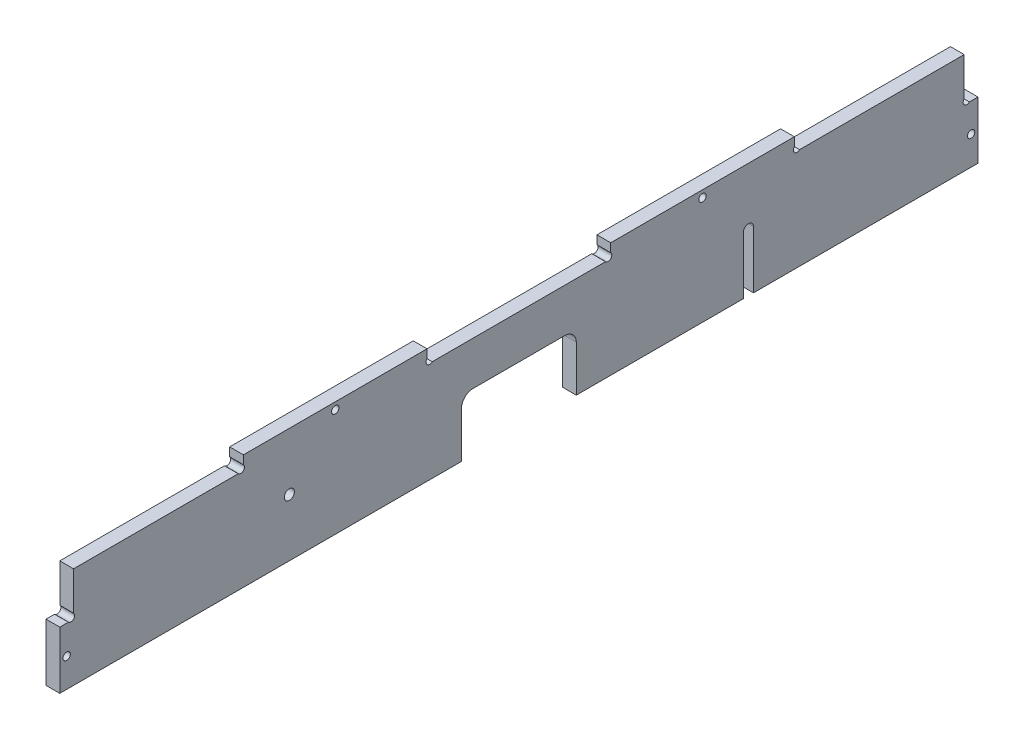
ISO-10303-21;
HEADER;
FILE_DESCRIPTION(('STEP AP214'),'2;1');
FILE_NAME('part.step','',(''),(''),'','','');
FILE_SCHEMA(('AUTOMOTIVE_DESIGN { 1 0 10303 214 1 1 1 1 }'));
ENDSEC;
DATA;
#1=APPLICATION_CONTEXT('core data for automotive mechanical design processes');
#2=APPLICATION_PROTOCOL_DEFINITION('international standard','automotive_design',2000,#1);
#3=PRODUCT_CONTEXT('',#1,'mechanical');
#4=PRODUCT('Part','Part','',(#3));
#5=PRODUCT_RELATED_PRODUCT_CATEGORY('part','',(#4));
#6=PRODUCT_DEFINITION_FORMATION('','',#4);
#7=PRODUCT_DEFINITION_CONTEXT('part definition',#1,'design');
#8=PRODUCT_DEFINITION('design','',#6,#7);
#9=PRODUCT_DEFINITION_SHAPE('','',#8);
#10=(LENGTH_UNIT() NAMED_UNIT(*) SI_UNIT(.MILLI.,.METRE.));
#11=(NAMED_UNIT(*) PLANE_ANGLE_UNIT() SI_UNIT($,.RADIAN.));
#12=(NAMED_UNIT(*) SI_UNIT($,.STERADIAN.) SOLID_ANGLE_UNIT());
#13=UNCERTAINTY_MEASURE_WITH_UNIT(LENGTH_MEASURE(1.E-05),#10,'distance_accuracy_value','');
#14=(GEOMETRIC_REPRESENTATION_CONTEXT(3) GLOBAL_UNCERTAINTY_ASSIGNED_CONTEXT((#13)) GLOBAL_UNIT_ASSIGNED_CONTEXT((#10,
#11,#12)) REPRESENTATION_CONTEXT('',''));
#15=CARTESIAN_POINT('',(0.,0.,0.));
#16=DIRECTION('',(0.,0.,1.));
#17=DIRECTION('',(1.,0.,0.));
#18=AXIS2_PLACEMENT_3D('',#15,#16,#17);
#19=CARTESIAN_POINT('',(6.,45.1313708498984,-38.8686291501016));
#20=DIRECTION('',(1.,0.,0.));
#21=DIRECTION('',(0.,0.,-1.));
#22=AXIS2_PLACEMENT_3D('',#19,#20,#21);
#23=PLANE('',#22);
#24=CARTESIAN_POINT('',(6.,12.5,197.));
#25=DIRECTION('',(1.,0.,0.));
#26=DIRECTION('',(0.,0.,1.));
#27=AXIS2_PLACEMENT_3D('',#24,#25,#26);
#28=CIRCLE('',#27,1.59999999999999);
#29=CARTESIAN_POINT('',(6.,12.5,198.6));
#30=VERTEX_POINT('',#29);
#31=EDGE_CURVE('E560',#30,#30,#28,.T.);
#32=ORIENTED_EDGE('',*,*,#31,.F.);
#33=EDGE_LOOP('',(#32));
#34=FACE_BOUND('',#33,.T.);
#35=CARTESIAN_POINT('',(6.,47.,80.));
#36=DIRECTION('',(1.,0.,0.));
#37=DIRECTION('',(0.,0.,1.));
#38=AXIS2_PLACEMENT_3D('',#35,#36,#37);
#39=CIRCLE('',#38,1.60000000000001);
#40=CARTESIAN_POINT('',(6.,47.,81.6));
#41=VERTEX_POINT('',#40);
#42=EDGE_CURVE('E572',#41,#41,#39,.T.);
#43=ORIENTED_EDGE('',*,*,#42,.F.);
#44=EDGE_LOOP('',(#43));
#45=FACE_BOUND('',#44,.T.);
#46=CARTESIAN_POINT('',(6.,45.1313708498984,-38.8686291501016));
#47=DIRECTION('',(-1.,0.,0.));
#48=DIRECTION('',(0.,0.,-1.));
#49=AXIS2_PLACEMENT_3D('',#46,#47,#48);
#50=CIRCLE('',#49,1.59999999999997);
#51=CARTESIAN_POINT('',(6.,46.2627416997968,-40.));
#52=VERTEX_POINT('',#51);
#53=CARTESIAN_POINT('',(6.,44.,-37.737258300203));
#54=VERTEX_POINT('',#53);
#55=EDGE_CURVE('E341',#52,#54,#50,.T.);
#56=ORIENTED_EDGE('',*,*,#55,.T.);
#57=DIRECTION('',(0.,0.,1.));
#58=VECTOR('',#57,1.);
#59=CARTESIAN_POINT('',(6.,44.,37.737258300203));
#60=LINE('',#59,#58);
#61=CARTESIAN_POINT('',(6.,44.,37.737258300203));
#62=VERTEX_POINT('',#61);
#63=EDGE_CURVE('E169',#54,#62,#60,.T.);
#64=ORIENTED_EDGE('',*,*,#63,.T.);
#65=CARTESIAN_POINT('',(6.,45.1313708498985,38.8686291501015));
#66=DIRECTION('',(-1.,0.,0.));
#67=DIRECTION('',(0.,0.,1.));
#68=AXIS2_PLACEMENT_3D('',#65,#66,#67);
#69=CIRCLE('',#68,1.60000000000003);
#70=CARTESIAN_POINT('',(6.,46.262741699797,40.));
#71=VERTEX_POINT('',#70);
#72=EDGE_CURVE('E428',#62,#71,#69,.T.);
#73=ORIENTED_EDGE('',*,*,#72,.T.);
#74=DIRECTION('',(0.,1.,0.));
#75=VECTOR('',#74,1.);
#76=CARTESIAN_POINT('',(6.,46.262741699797,40.));
#77=LINE('',#76,#75);
#78=CARTESIAN_POINT('',(6.,50.,40.));
#79=VERTEX_POINT('',#78);
#80=EDGE_CURVE('E447',#71,#79,#77,.T.);
#81=ORIENTED_EDGE('',*,*,#80,.T.);
#82=DIRECTION('',(0.,0.,1.));
#83=VECTOR('',#82,1.);
#84=CARTESIAN_POINT('',(6.,50.,40.));
#85=LINE('',#84,#83);
#86=CARTESIAN_POINT('',(6.,50.,120.));
#87=VERTEX_POINT('',#86);
#88=EDGE_CURVE('E444',#79,#87,#85,.T.);
#89=ORIENTED_EDGE('',*,*,#88,.T.);
#90=DIRECTION('',(0.,-1.,0.));
#91=VECTOR('',#90,1.);
#92=CARTESIAN_POINT('',(6.,50.,120.));
#93=LINE('',#92,#91);
#94=CARTESIAN_POINT('',(6.,46.262741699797,120.));
#95=VERTEX_POINT('',#94);
#96=EDGE_CURVE('E446',#87,#95,#93,.T.);
#97=ORIENTED_EDGE('',*,*,#96,.T.);
#98=CARTESIAN_POINT('',(6.,45.1313708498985,121.131370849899));
#99=DIRECTION('',(-1.,0.,0.));
#100=DIRECTION('',(0.,0.,-1.));
#101=AXIS2_PLACEMENT_3D('',#98,#99,#100);
#102=CIRCLE('',#101,1.60000000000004);
#103=CARTESIAN_POINT('',(6.,44.,122.262741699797));
#104=VERTEX_POINT('',#103);
#105=EDGE_CURVE('E449',#95,#104,#102,.T.);
#106=ORIENTED_EDGE('',*,*,#105,.T.);
#107=DIRECTION('',(0.,0.,1.));
#108=VECTOR('',#107,1.);
#109=CARTESIAN_POINT('',(6.,44.,122.262741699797));
#110=LINE('',#109,#108);
#111=CARTESIAN_POINT('',(6.,44.,194.));
#112=VERTEX_POINT('',#111);
#113=EDGE_CURVE('E455',#104,#112,#110,.T.);
#114=ORIENTED_EDGE('',*,*,#113,.T.);
#115=DIRECTION('',(0.,-1.,0.));
#116=VECTOR('',#115,1.);
#117=CARTESIAN_POINT('',(6.,44.,194.));
#118=LINE('',#117,#116);
#119=CARTESIAN_POINT('',(6.,27.2627416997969,194.));
#120=VERTEX_POINT('',#119);
#121=EDGE_CURVE('E457',#112,#120,#118,.T.);
#122=ORIENTED_EDGE('',*,*,#121,.T.);
#123=CARTESIAN_POINT('',(6.,26.1313708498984,195.131370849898));
#124=DIRECTION('',(-1.,0.,0.));
#125=DIRECTION('',(0.,0.,1.));
#126=AXIS2_PLACEMENT_3D('',#123,#124,#125);
#127=CIRCLE('',#126,1.59999999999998);
#128=CARTESIAN_POINT('',(6.,25.,196.262741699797));
#129=VERTEX_POINT('',#128);
#130=EDGE_CURVE('E459',#120,#129,#127,.T.);
#131=ORIENTED_EDGE('',*,*,#130,.T.);
#132=DIRECTION('',(0.,0.,1.));
#133=VECTOR('',#132,1.);
#134=CARTESIAN_POINT('',(6.,25.,196.262741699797));
#135=LINE('',#134,#133);
#136=CARTESIAN_POINT('',(6.,25.,200.));
#137=VERTEX_POINT('',#136);
#138=EDGE_CURVE('E461',#129,#137,#135,.T.);
#139=ORIENTED_EDGE('',*,*,#138,.T.);
#140=DIRECTION('',(0.,-1.,0.));
#141=VECTOR('',#140,1.);
#142=CARTESIAN_POINT('',(6.,25.,200.));
#143=LINE('',#142,#141);
#144=CARTESIAN_POINT('',(6.,0.,200.));
#145=VERTEX_POINT('',#144);
#146=EDGE_CURVE('E463',#137,#145,#143,.T.);
#147=ORIENTED_EDGE('',*,*,#146,.T.);
#148=DIRECTION('',(0.,0.,-1.));
#149=VECTOR('',#148,1.);
#150=CARTESIAN_POINT('',(6.,0.,200.));
#151=LINE('',#150,#149);
#152=CARTESIAN_POINT('',(6.,0.,25.));
#153=VERTEX_POINT('',#152);
#154=EDGE_CURVE('E465',#145,#153,#151,.T.);
#155=ORIENTED_EDGE('',*,*,#154,.T.);
#156=DIRECTION('',(0.,1.,0.));
#157=VECTOR('',#156,1.);
#158=CARTESIAN_POINT('',(6.,20.,25.));
#159=LINE('',#158,#157);
#160=CARTESIAN_POINT('',(6.,20.,25.));
#161=VERTEX_POINT('',#160);
#162=EDGE_CURVE('E467',#153,#161,#159,.T.);
#163=ORIENTED_EDGE('',*,*,#162,.T.);
#164=CARTESIAN_POINT('',(6.,20.,20.));
#165=DIRECTION('',(-1.,0.,0.));
#166=DIRECTION('',(0.,0.,1.));
#167=AXIS2_PLACEMENT_3D('',#164,#165,#166);
#168=CIRCLE('',#167,5.);
#169=CARTESIAN_POINT('',(6.,25.,20.));
#170=VERTEX_POINT('',#169);
#171=EDGE_CURVE('E469',#161,#170,#168,.T.);
#172=ORIENTED_EDGE('',*,*,#171,.T.);
#173=DIRECTION('',(0.,0.,-1.));
#174=VECTOR('',#173,1.);
#175=CARTESIAN_POINT('',(6.,25.,20.));
#176=LINE('',#175,#174);
#177=CARTESIAN_POINT('',(6.,25.,-20.));
#178=VERTEX_POINT('',#177);
#179=EDGE_CURVE('E471',#170,#178,#176,.T.);
#180=ORIENTED_EDGE('',*,*,#179,.T.);
#181=CARTESIAN_POINT('',(6.,20.,-20.));
#182=DIRECTION('',(-1.,0.,0.));
#183=DIRECTION('',(0.,0.,-1.));
#184=AXIS2_PLACEMENT_3D('',#181,#182,#183);
#185=CIRCLE('',#184,5.);
#186=CARTESIAN_POINT('',(6.,20.,-25.));
#187=VERTEX_POINT('',#186);
#188=EDGE_CURVE('E473',#178,#187,#185,.T.);
#189=ORIENTED_EDGE('',*,*,#188,.T.);
#190=DIRECTION('',(0.,-1.,0.));
#191=VECTOR('',#190,1.);
#192=CARTESIAN_POINT('',(6.,20.,-25.));
#193=LINE('',#192,#191);
#194=CARTESIAN_POINT('',(6.,0.,-25.));
#195=VERTEX_POINT('',#194);
#196=EDGE_CURVE('E475',#187,#195,#193,.T.);
#197=ORIENTED_EDGE('',*,*,#196,.T.);
#198=DIRECTION('',(0.,0.,-1.));
#199=VECTOR('',#198,1.);
#200=CARTESIAN_POINT('',(6.,0.,-25.));
#201=LINE('',#200,#199);
#202=CARTESIAN_POINT('',(6.,0.,-97.8));
#203=VERTEX_POINT('',#202);
#204=EDGE_CURVE('E477',#195,#203,#201,.T.);
#205=ORIENTED_EDGE('',*,*,#204,.T.);
#206=DIRECTION('',(0.,1.,0.));
#207=VECTOR('',#206,1.);
#208=CARTESIAN_POINT('',(6.,25.,-97.8));
#209=LINE('',#208,#207);
#210=CARTESIAN_POINT('',(6.,25.,-97.8));
#211=VERTEX_POINT('',#210);
#212=EDGE_CURVE('E479',#203,#211,#209,.T.);
#213=ORIENTED_EDGE('',*,*,#212,.T.);
#214=CARTESIAN_POINT('',(6.,25.,-100.));
#215=DIRECTION('',(-1.,0.,0.));
#216=DIRECTION('',(0.,0.,1.));
#217=AXIS2_PLACEMENT_3D('',#214,#215,#216);
#218=CIRCLE('',#217,2.19999999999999);
#219=CARTESIAN_POINT('',(6.,25.,-102.2));
#220=VERTEX_POINT('',#219);
#221=EDGE_CURVE('E481',#211,#220,#218,.T.);
#222=ORIENTED_EDGE('',*,*,#221,.T.);
#223=DIRECTION('',(0.,-1.,0.));
#224=VECTOR('',#223,1.);
#225=CARTESIAN_POINT('',(6.,25.,-102.2));
#226=LINE('',#225,#224);
#227=CARTESIAN_POINT('',(6.,0.,-102.2));
#228=VERTEX_POINT('',#227);
#229=EDGE_CURVE('E483',#220,#228,#226,.T.);
#230=ORIENTED_EDGE('',*,*,#229,.T.);
#231=DIRECTION('',(0.,0.,-1.));
#232=VECTOR('',#231,1.);
#233=CARTESIAN_POINT('',(6.,0.,-102.2));
#234=LINE('',#233,#232);
#235=CARTESIAN_POINT('',(6.,0.,-200.));
#236=VERTEX_POINT('',#235);
#237=EDGE_CURVE('E485',#228,#236,#234,.T.);
#238=ORIENTED_EDGE('',*,*,#237,.T.);
#239=DIRECTION('',(0.,1.,0.));
#240=VECTOR('',#239,1.);
#241=CARTESIAN_POINT('',(6.,25.,-200.));
#242=LINE('',#241,#240);
#243=CARTESIAN_POINT('',(6.,25.,-200.));
#244=VERTEX_POINT('',#243);
#245=EDGE_CURVE('E487',#236,#244,#242,.T.);
#246=ORIENTED_EDGE('',*,*,#245,.T.);
#247=DIRECTION('',(0.,0.,1.));
#248=VECTOR('',#247,1.);
#249=CARTESIAN_POINT('',(6.,25.,-196.262741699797));
#250=LINE('',#249,#248);
#251=CARTESIAN_POINT('',(6.,25.,-196.262741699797));
#252=VERTEX_POINT('',#251);
#253=EDGE_CURVE('E489',#244,#252,#250,.T.);
#254=ORIENTED_EDGE('',*,*,#253,.T.);
#255=CARTESIAN_POINT('',(6.,26.1313708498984,-195.131370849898));
#256=DIRECTION('',(-1.,0.,0.));
#257=DIRECTION('',(0.,0.,-1.));
#258=AXIS2_PLACEMENT_3D('',#255,#256,#257);
#259=CIRCLE('',#258,1.59999999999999);
#260=CARTESIAN_POINT('',(6.,27.2627416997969,-194.));
#261=VERTEX_POINT('',#260);
#262=EDGE_CURVE('E491',#252,#261,#259,.T.);
#263=ORIENTED_EDGE('',*,*,#262,.T.);
#264=DIRECTION('',(0.,1.,0.));
#265=VECTOR('',#264,1.);
#266=CARTESIAN_POINT('',(6.,44.,-194.));
#267=LINE('',#266,#265);
#268=CARTESIAN_POINT('',(6.,44.,-194.));
#269=VERTEX_POINT('',#268);
#270=EDGE_CURVE('E493',#261,#269,#267,.T.);
#271=ORIENTED_EDGE('',*,*,#270,.T.);
#272=DIRECTION('',(0.,0.,1.));
#273=VECTOR('',#272,1.);
#274=CARTESIAN_POINT('',(6.,44.,-122.262741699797));
#275=LINE('',#274,#273);
#276=CARTESIAN_POINT('',(6.,44.,-122.262741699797));
#277=VERTEX_POINT('',#276);
#278=EDGE_CURVE('E495',#269,#277,#275,.T.);
#279=ORIENTED_EDGE('',*,*,#278,.T.);
#280=CARTESIAN_POINT('',(6.,45.1313708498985,-121.131370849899));
#281=DIRECTION('',(-1.,0.,0.));
#282=DIRECTION('',(0.,0.,1.));
#283=AXIS2_PLACEMENT_3D('',#280,#281,#282);
#284=CIRCLE('',#283,1.60000000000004);
#285=CARTESIAN_POINT('',(6.,46.262741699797,-120.));
#286=VERTEX_POINT('',#285);
#287=EDGE_CURVE('E260',#277,#286,#284,.T.);
#288=ORIENTED_EDGE('',*,*,#287,.T.);
#289=DIRECTION('',(0.,1.,0.));
#290=VECTOR('',#289,1.);
#291=CARTESIAN_POINT('',(6.,50.,-120.));
#292=LINE('',#291,#290);
#293=CARTESIAN_POINT('',(6.,50.,-120.));
#294=VERTEX_POINT('',#293);
#295=EDGE_CURVE('E254',#286,#294,#292,.T.);
#296=ORIENTED_EDGE('',*,*,#295,.T.);
#297=DIRECTION('',(0.,0.,1.));
#298=VECTOR('',#297,1.);
#299=CARTESIAN_POINT('',(6.,50.,-40.));
#300=LINE('',#299,#298);
#301=CARTESIAN_POINT('',(6.,50.,-40.));
#302=VERTEX_POINT('',#301);
#303=EDGE_CURVE('E258',#294,#302,#300,.T.);
#304=ORIENTED_EDGE('',*,*,#303,.T.);
#305=DIRECTION('',(0.,-1.,0.));
#306=VECTOR('',#305,1.);
#307=CARTESIAN_POINT('',(6.,46.2627416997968,-40.));
#308=LINE('',#307,#306);
#309=EDGE_CURVE('E54',#302,#52,#308,.T.);
#310=ORIENTED_EDGE('',*,*,#309,.T.);
#311=EDGE_LOOP('',(#56,#64,#73,#81,#89,#97,#106,#114,#122,#131,#139,#147,#155,#163,#172,#180,
#189,#197,#205,#213,#222,#230,#238,#246,#254,#263,#271,#279,#288,#296,#304,#310));
#312=FACE_BOUND('',#311,.T.);
#313=CARTESIAN_POINT('',(6.,47.,-80.));
#314=DIRECTION('',(1.,0.,0.));
#315=DIRECTION('',(0.,0.,-1.));
#316=AXIS2_PLACEMENT_3D('',#313,#314,#315);
#317=CIRCLE('',#316,1.60000000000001);
#318=CARTESIAN_POINT('',(6.,47.,-81.6));
#319=VERTEX_POINT('',#318);
#320=EDGE_CURVE('E282',#319,#319,#317,.T.);
#321=ORIENTED_EDGE('',*,*,#320,.F.);
#322=EDGE_LOOP('',(#321));
#323=FACE_BOUND('',#322,.T.);
#324=CARTESIAN_POINT('',(6.,12.5,-197.));
#325=DIRECTION('',(1.,0.,0.));
#326=DIRECTION('',(0.,0.,-1.));
#327=AXIS2_PLACEMENT_3D('',#324,#325,#326);
#328=CIRCLE('',#327,1.59999999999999);
#329=CARTESIAN_POINT('',(6.,12.5,-198.6));
#330=VERTEX_POINT('',#329);
#331=EDGE_CURVE('E566',#330,#330,#328,.T.);
#332=ORIENTED_EDGE('',*,*,#331,.F.);
#333=EDGE_LOOP('',(#332));
#334=FACE_BOUND('',#333,.T.);
#335=CARTESIAN_POINT('',(6.,25.,100.));
#336=DIRECTION('',(1.,0.,0.));
#337=DIRECTION('',(0.,0.,-1.));
#338=AXIS2_PLACEMENT_3D('',#335,#336,#337);
#339=CIRCLE('',#338,2.2);
#340=CARTESIAN_POINT('',(6.,25.,97.8));
#341=VERTEX_POINT('',#340);
#342=EDGE_CURVE('E551',#341,#341,#339,.T.);
#343=ORIENTED_EDGE('',*,*,#342,.F.);
#344=EDGE_LOOP('',(#343));
#345=FACE_BOUND('',#344,.T.);
#346=ADVANCED_FACE('F37',(#34,#45,#312,#323,#334,#345),#23,.T.);
#347=CARTESIAN_POINT('',(0.,45.1313708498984,-38.8686291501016));
#348=DIRECTION('',(1.,0.,0.));
#349=DIRECTION('',(0.,0.,-1.));
#350=AXIS2_PLACEMENT_3D('',#347,#348,#349);
#351=PLANE('',#350);
#352=CARTESIAN_POINT('',(0.,12.5,197.));
#353=DIRECTION('',(1.,0.,0.));
#354=DIRECTION('',(0.,0.,1.));
#355=AXIS2_PLACEMENT_3D('',#352,#353,#354);
#356=CIRCLE('',#355,1.59999999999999);
#357=CARTESIAN_POINT('',(0.,12.5,198.6));
#358=VERTEX_POINT('',#357);
#359=EDGE_CURVE('E557',#358,#358,#356,.T.);
#360=ORIENTED_EDGE('',*,*,#359,.T.);
#361=EDGE_LOOP('',(#360));
#362=FACE_BOUND('',#361,.T.);
#363=CARTESIAN_POINT('',(0.,47.,80.));
#364=DIRECTION('',(1.,0.,0.));
#365=DIRECTION('',(0.,0.,1.));
#366=AXIS2_PLACEMENT_3D('',#363,#364,#365);
#367=CIRCLE('',#366,1.60000000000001);
#368=CARTESIAN_POINT('',(0.,47.,81.6));
#369=VERTEX_POINT('',#368);
#370=EDGE_CURVE('E569',#369,#369,#367,.T.);
#371=ORIENTED_EDGE('',*,*,#370,.T.);
#372=EDGE_LOOP('',(#371));
#373=FACE_BOUND('',#372,.T.);
#374=CARTESIAN_POINT('',(0.,45.1313708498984,-38.8686291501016));
#375=DIRECTION('',(-1.,0.,0.));
#376=DIRECTION('',(0.,0.,-1.));
#377=AXIS2_PLACEMENT_3D('',#374,#375,#376);
#378=CIRCLE('',#377,1.59999999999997);
#379=CARTESIAN_POINT('',(0.,46.2627416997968,-40.));
#380=VERTEX_POINT('',#379);
#381=CARTESIAN_POINT('',(0.,44.,-37.737258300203));
#382=VERTEX_POINT('',#381);
#383=EDGE_CURVE('E278',#380,#382,#378,.T.);
#384=ORIENTED_EDGE('',*,*,#383,.F.);
#385=DIRECTION('',(0.,-1.,0.));
#386=VECTOR('',#385,1.);
#387=CARTESIAN_POINT('',(0.,46.2627416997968,-40.));
#388=LINE('',#387,#386);
#389=CARTESIAN_POINT('',(0.,50.,-40.));
#390=VERTEX_POINT('',#389);
#391=EDGE_CURVE('E161',#390,#380,#388,.T.);
#392=ORIENTED_EDGE('',*,*,#391,.F.);
#393=DIRECTION('',(0.,0.,1.));
#394=VECTOR('',#393,1.);
#395=CARTESIAN_POINT('',(0.,50.,-40.));
#396=LINE('',#395,#394);
#397=CARTESIAN_POINT('',(0.,50.,-120.));
#398=VERTEX_POINT('',#397);
#399=EDGE_CURVE('E155',#398,#390,#396,.T.);
#400=ORIENTED_EDGE('',*,*,#399,.F.);
#401=DIRECTION('',(0.,1.,0.));
#402=VECTOR('',#401,1.);
#403=CARTESIAN_POINT('',(0.,50.,-120.));
#404=LINE('',#403,#402);
#405=CARTESIAN_POINT('',(0.,46.262741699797,-120.));
#406=VERTEX_POINT('',#405);
#407=EDGE_CURVE('E268',#406,#398,#404,.T.);
#408=ORIENTED_EDGE('',*,*,#407,.F.);
#409=CARTESIAN_POINT('',(0.,45.1313708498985,-121.131370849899));
#410=DIRECTION('',(-1.,0.,0.));
#411=DIRECTION('',(0.,0.,1.));
#412=AXIS2_PLACEMENT_3D('',#409,#410,#411);
#413=CIRCLE('',#412,1.60000000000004);
#414=CARTESIAN_POINT('',(0.,44.,-122.262741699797));
#415=VERTEX_POINT('',#414);
#416=EDGE_CURVE('E336',#415,#406,#413,.T.);
#417=ORIENTED_EDGE('',*,*,#416,.F.);
#418=DIRECTION('',(0.,0.,1.));
#419=VECTOR('',#418,1.);
#420=CARTESIAN_POINT('',(0.,44.,-122.262741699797));
#421=LINE('',#420,#419);
#422=CARTESIAN_POINT('',(0.,44.,-194.));
#423=VERTEX_POINT('',#422);
#424=EDGE_CURVE('E334',#423,#415,#421,.T.);
#425=ORIENTED_EDGE('',*,*,#424,.F.);
#426=DIRECTION('',(0.,1.,0.));
#427=VECTOR('',#426,1.);
#428=CARTESIAN_POINT('',(0.,44.,-194.));
#429=LINE('',#428,#427);
#430=CARTESIAN_POINT('',(0.,27.2627416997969,-194.));
#431=VERTEX_POINT('',#430);
#432=EDGE_CURVE('E332',#431,#423,#429,.T.);
#433=ORIENTED_EDGE('',*,*,#432,.F.);
#434=CARTESIAN_POINT('',(0.,26.1313708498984,-195.131370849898));
#435=DIRECTION('',(-1.,0.,0.));
#436=DIRECTION('',(0.,0.,-1.));
#437=AXIS2_PLACEMENT_3D('',#434,#435,#436);
#438=CIRCLE('',#437,1.59999999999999);
#439=CARTESIAN_POINT('',(0.,25.,-196.262741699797));
#440=VERTEX_POINT('',#439);
#441=EDGE_CURVE('E330',#440,#431,#438,.T.);
#442=ORIENTED_EDGE('',*,*,#441,.F.);
#443=DIRECTION('',(0.,0.,1.));
#444=VECTOR('',#443,1.);
#445=CARTESIAN_POINT('',(0.,25.,-196.262741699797));
#446=LINE('',#445,#444);
#447=CARTESIAN_POINT('',(0.,25.,-200.));
#448=VERTEX_POINT('',#447);
#449=EDGE_CURVE('E328',#448,#440,#446,.T.);
#450=ORIENTED_EDGE('',*,*,#449,.F.);
#451=DIRECTION('',(0.,1.,0.));
#452=VECTOR('',#451,1.);
#453=CARTESIAN_POINT('',(0.,25.,-200.));
#454=LINE('',#453,#452);
#455=CARTESIAN_POINT('',(0.,0.,-200.));
#456=VERTEX_POINT('',#455);
#457=EDGE_CURVE('E326',#456,#448,#454,.T.);
#458=ORIENTED_EDGE('',*,*,#457,.F.);
#459=DIRECTION('',(0.,0.,-1.));
#460=VECTOR('',#459,1.);
#461=CARTESIAN_POINT('',(0.,0.,-102.2));
#462=LINE('',#461,#460);
#463=CARTESIAN_POINT('',(0.,0.,-102.2));
#464=VERTEX_POINT('',#463);
#465=EDGE_CURVE('E324',#464,#456,#462,.T.);
#466=ORIENTED_EDGE('',*,*,#465,.F.);
#467=DIRECTION('',(0.,-1.,0.));
#468=VECTOR('',#467,1.);
#469=CARTESIAN_POINT('',(0.,25.,-102.2));
#470=LINE('',#469,#468);
#471=CARTESIAN_POINT('',(0.,25.,-102.2));
#472=VERTEX_POINT('',#471);
#473=EDGE_CURVE('E322',#472,#464,#470,.T.);
#474=ORIENTED_EDGE('',*,*,#473,.F.);
#475=CARTESIAN_POINT('',(0.,25.,-100.));
#476=DIRECTION('',(-1.,0.,0.));
#477=DIRECTION('',(0.,0.,1.));
#478=AXIS2_PLACEMENT_3D('',#475,#476,#477);
#479=CIRCLE('',#478,2.19999999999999);
#480=CARTESIAN_POINT('',(0.,25.,-97.8));
#481=VERTEX_POINT('',#480);
#482=EDGE_CURVE('E320',#481,#472,#479,.T.);
#483=ORIENTED_EDGE('',*,*,#482,.F.);
#484=DIRECTION('',(0.,1.,0.));
#485=VECTOR('',#484,1.);
#486=CARTESIAN_POINT('',(0.,25.,-97.8));
#487=LINE('',#486,#485);
#488=CARTESIAN_POINT('',(0.,0.,-97.8));
#489=VERTEX_POINT('',#488);
#490=EDGE_CURVE('E318',#489,#481,#487,.T.);
#491=ORIENTED_EDGE('',*,*,#490,.F.);
#492=DIRECTION('',(0.,0.,-1.));
#493=VECTOR('',#492,1.);
#494=CARTESIAN_POINT('',(0.,0.,-25.));
#495=LINE('',#494,#493);
#496=CARTESIAN_POINT('',(0.,0.,-25.));
#497=VERTEX_POINT('',#496);
#498=EDGE_CURVE('E316',#497,#489,#495,.T.);
#499=ORIENTED_EDGE('',*,*,#498,.F.);
#500=DIRECTION('',(0.,-1.,0.));
#501=VECTOR('',#500,1.);
#502=CARTESIAN_POINT('',(0.,20.,-25.));
#503=LINE('',#502,#501);
#504=CARTESIAN_POINT('',(0.,20.,-25.));
#505=VERTEX_POINT('',#504);
#506=EDGE_CURVE('E314',#505,#497,#503,.T.);
#507=ORIENTED_EDGE('',*,*,#506,.F.);
#508=CARTESIAN_POINT('',(0.,20.,-20.));
#509=DIRECTION('',(-1.,0.,0.));
#510=DIRECTION('',(0.,0.,-1.));
#511=AXIS2_PLACEMENT_3D('',#508,#509,#510);
#512=CIRCLE('',#511,5.);
#513=CARTESIAN_POINT('',(0.,25.,-20.));
#514=VERTEX_POINT('',#513);
#515=EDGE_CURVE('E312',#514,#505,#512,.T.);
#516=ORIENTED_EDGE('',*,*,#515,.F.);
#517=DIRECTION('',(0.,0.,-1.));
#518=VECTOR('',#517,1.);
#519=CARTESIAN_POINT('',(0.,25.,20.));
#520=LINE('',#519,#518);
#521=CARTESIAN_POINT('',(0.,25.,20.));
#522=VERTEX_POINT('',#521);
#523=EDGE_CURVE('E310',#522,#514,#520,.T.);
#524=ORIENTED_EDGE('',*,*,#523,.F.);
#525=CARTESIAN_POINT('',(0.,20.,20.));
#526=DIRECTION('',(-1.,0.,0.));
#527=DIRECTION('',(0.,0.,1.));
#528=AXIS2_PLACEMENT_3D('',#525,#526,#527);
#529=CIRCLE('',#528,5.);
#530=CARTESIAN_POINT('',(0.,20.,25.));
#531=VERTEX_POINT('',#530);
#532=EDGE_CURVE('E308',#531,#522,#529,.T.);
#533=ORIENTED_EDGE('',*,*,#532,.F.);
#534=DIRECTION('',(0.,1.,0.));
#535=VECTOR('',#534,1.);
#536=CARTESIAN_POINT('',(0.,20.,25.));
#537=LINE('',#536,#535);
#538=CARTESIAN_POINT('',(0.,0.,25.));
#539=VERTEX_POINT('',#538);
#540=EDGE_CURVE('E306',#539,#531,#537,.T.);
#541=ORIENTED_EDGE('',*,*,#540,.F.);
#542=DIRECTION('',(0.,0.,-1.));
#543=VECTOR('',#542,1.);
#544=CARTESIAN_POINT('',(0.,0.,200.));
#545=LINE('',#544,#543);
#546=CARTESIAN_POINT('',(0.,0.,200.));
#547=VERTEX_POINT('',#546);
#548=EDGE_CURVE('E304',#547,#539,#545,.T.);
#549=ORIENTED_EDGE('',*,*,#548,.F.);
#550=DIRECTION('',(0.,-1.,0.));
#551=VECTOR('',#550,1.);
#552=CARTESIAN_POINT('',(0.,25.,200.));
#553=LINE('',#552,#551);
#554=CARTESIAN_POINT('',(0.,25.,200.));
#555=VERTEX_POINT('',#554);
#556=EDGE_CURVE('E302',#555,#547,#553,.T.);
#557=ORIENTED_EDGE('',*,*,#556,.F.);
#558=DIRECTION('',(0.,0.,1.));
#559=VECTOR('',#558,1.);
#560=CARTESIAN_POINT('',(0.,25.,196.262741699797));
#561=LINE('',#560,#559);
#562=CARTESIAN_POINT('',(0.,25.,196.262741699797));
#563=VERTEX_POINT('',#562);
#564=EDGE_CURVE('E300',#563,#555,#561,.T.);
#565=ORIENTED_EDGE('',*,*,#564,.F.);
#566=CARTESIAN_POINT('',(0.,26.1313708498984,195.131370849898));
#567=DIRECTION('',(-1.,0.,0.));
#568=DIRECTION('',(0.,0.,1.));
#569=AXIS2_PLACEMENT_3D('',#566,#567,#568);
#570=CIRCLE('',#569,1.59999999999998);
#571=CARTESIAN_POINT('',(0.,27.2627416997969,194.));
#572=VERTEX_POINT('',#571);
#573=EDGE_CURVE('E298',#572,#563,#570,.T.);
#574=ORIENTED_EDGE('',*,*,#573,.F.);
#575=DIRECTION('',(0.,-1.,0.));
#576=VECTOR('',#575,1.);
#577=CARTESIAN_POINT('',(0.,44.,194.));
#578=LINE('',#577,#576);
#579=CARTESIAN_POINT('',(0.,44.,194.));
#580=VERTEX_POINT('',#579);
#581=EDGE_CURVE('E296',#580,#572,#578,.T.);
#582=ORIENTED_EDGE('',*,*,#581,.F.);
#583=DIRECTION('',(0.,0.,1.));
#584=VECTOR('',#583,1.);
#585=CARTESIAN_POINT('',(0.,44.,122.262741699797));
#586=LINE('',#585,#584);
#587=CARTESIAN_POINT('',(0.,44.,122.262741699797));
#588=VERTEX_POINT('',#587);
#589=EDGE_CURVE('E294',#588,#580,#586,.T.);
#590=ORIENTED_EDGE('',*,*,#589,.F.);
#591=CARTESIAN_POINT('',(0.,45.1313708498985,121.131370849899));
#592=DIRECTION('',(-1.,0.,0.));
#593=DIRECTION('',(0.,0.,-1.));
#594=AXIS2_PLACEMENT_3D('',#591,#592,#593);
#595=CIRCLE('',#594,1.60000000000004);
#596=CARTESIAN_POINT('',(0.,46.262741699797,120.));
#597=VERTEX_POINT('',#596);
#598=EDGE_CURVE('E292',#597,#588,#595,.T.);
#599=ORIENTED_EDGE('',*,*,#598,.F.);
#600=DIRECTION('',(0.,-1.,0.));
#601=VECTOR('',#600,1.);
#602=CARTESIAN_POINT('',(0.,50.,120.));
#603=LINE('',#602,#601);
#604=CARTESIAN_POINT('',(0.,50.,120.));
#605=VERTEX_POINT('',#604);
#606=EDGE_CURVE('E290',#605,#597,#603,.T.);
#607=ORIENTED_EDGE('',*,*,#606,.F.);
#608=DIRECTION('',(0.,0.,1.));
#609=VECTOR('',#608,1.);
#610=CARTESIAN_POINT('',(0.,50.,40.));
#611=LINE('',#610,#609);
#612=CARTESIAN_POINT('',(0.,50.,40.));
#613=VERTEX_POINT('',#612);
#614=EDGE_CURVE('E288',#613,#605,#611,.T.);
#615=ORIENTED_EDGE('',*,*,#614,.F.);
#616=DIRECTION('',(0.,1.,0.));
#617=VECTOR('',#616,1.);
#618=CARTESIAN_POINT('',(0.,46.262741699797,40.));
#619=LINE('',#618,#617);
#620=CARTESIAN_POINT('',(0.,46.262741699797,40.));
#621=VERTEX_POINT('',#620);
#622=EDGE_CURVE('E286',#621,#613,#619,.T.);
#623=ORIENTED_EDGE('',*,*,#622,.F.);
#624=CARTESIAN_POINT('',(0.,45.1313708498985,38.8686291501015));
#625=DIRECTION('',(-1.,0.,0.));
#626=DIRECTION('',(0.,0.,1.));
#627=AXIS2_PLACEMENT_3D('',#624,#625,#626);
#628=CIRCLE('',#627,1.60000000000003);
#629=CARTESIAN_POINT('',(0.,44.,37.737258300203));
#630=VERTEX_POINT('',#629);
#631=EDGE_CURVE('E284',#630,#621,#628,.T.);
#632=ORIENTED_EDGE('',*,*,#631,.F.);
#633=DIRECTION('',(0.,0.,1.));
#634=VECTOR('',#633,1.);
#635=CARTESIAN_POINT('',(0.,44.,37.737258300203));
#636=LINE('',#635,#634);
#637=EDGE_CURVE('E281',#382,#630,#636,.T.);
#638=ORIENTED_EDGE('',*,*,#637,.F.);
#639=EDGE_LOOP('',(#384,#392,#400,#408,#417,#425,#433,#442,#450,#458,#466,#474,#483,#491,#499,
#507,#516,#524,#533,#541,#549,#557,#565,#574,#582,#590,#599,#607,#615,#623,#632,#638));
#640=FACE_BOUND('',#639,.T.);
#641=CARTESIAN_POINT('',(0.,47.,-80.));
#642=DIRECTION('',(1.,0.,0.));
#643=DIRECTION('',(0.,0.,-1.));
#644=AXIS2_PLACEMENT_3D('',#641,#642,#643);
#645=CIRCLE('',#644,1.60000000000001);
#646=CARTESIAN_POINT('',(0.,47.,-81.6));
#647=VERTEX_POINT('',#646);
#648=EDGE_CURVE('E575',#647,#647,#645,.T.);
#649=ORIENTED_EDGE('',*,*,#648,.T.);
#650=EDGE_LOOP('',(#649));
#651=FACE_BOUND('',#650,.T.);
#652=CARTESIAN_POINT('',(0.,12.5,-197.));
#653=DIRECTION('',(1.,0.,0.));
#654=DIRECTION('',(0.,0.,-1.));
#655=AXIS2_PLACEMENT_3D('',#652,#653,#654);
#656=CIRCLE('',#655,1.59999999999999);
#657=CARTESIAN_POINT('',(0.,12.5,-198.6));
#658=VERTEX_POINT('',#657);
#659=EDGE_CURVE('E563',#658,#658,#656,.T.);
#660=ORIENTED_EDGE('',*,*,#659,.T.);
#661=EDGE_LOOP('',(#660));
#662=FACE_BOUND('',#661,.T.);
#663=CARTESIAN_POINT('',(0.,25.,100.));
#664=DIRECTION('',(1.,0.,0.));
#665=DIRECTION('',(0.,0.,-1.));
#666=AXIS2_PLACEMENT_3D('',#663,#664,#665);
#667=CIRCLE('',#666,2.2);
#668=CARTESIAN_POINT('',(0.,25.,97.8));
#669=VERTEX_POINT('',#668);
#670=EDGE_CURVE('E554',#669,#669,#667,.T.);
#671=ORIENTED_EDGE('',*,*,#670,.T.);
#672=EDGE_LOOP('',(#671));
#673=FACE_BOUND('',#672,.T.);
#674=ADVANCED_FACE('F432',(#362,#373,#640,#651,#662,#673),#351,.F.);
#675=CARTESIAN_POINT('',(6.,45.1313708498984,-38.8686291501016));
#676=DIRECTION('',(-1.,0.,0.));
#677=DIRECTION('',(0.,0.,1.));
#678=AXIS2_PLACEMENT_3D('',#675,#676,#677);
#679=CYLINDRICAL_SURFACE('',#678,1.59999999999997);
#680=ORIENTED_EDGE('',*,*,#383,.T.);
#681=DIRECTION('',(-1.,0.,0.));
#682=VECTOR('',#681,1.);
#683=CARTESIAN_POINT('',(6.,44.,-37.737258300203));
#684=LINE('',#683,#682);
#685=EDGE_CURVE('E11',#54,#382,#684,.T.);
#686=ORIENTED_EDGE('',*,*,#685,.F.);
#687=ORIENTED_EDGE('',*,*,#55,.F.);
#688=DIRECTION('',(-1.,0.,0.));
#689=VECTOR('',#688,1.);
#690=CARTESIAN_POINT('',(6.,46.2627416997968,-40.));
#691=LINE('',#690,#689);
#692=EDGE_CURVE('E274',#52,#380,#691,.T.);
#693=ORIENTED_EDGE('',*,*,#692,.T.);
#694=EDGE_LOOP('',(#680,#686,#687,#693));
#695=FACE_BOUND('',#694,.T.);
#696=ADVANCED_FACE('F39',(#695),#679,.F.);
#697=CARTESIAN_POINT('',(6.,44.,37.737258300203));
#698=DIRECTION('',(0.,-1.,0.));
#699=DIRECTION('',(0.,0.,-1.));
#700=AXIS2_PLACEMENT_3D('',#697,#698,#699);
#701=PLANE('',#700);
#702=ORIENTED_EDGE('',*,*,#637,.T.);
#703=DIRECTION('',(-1.,0.,0.));
#704=VECTOR('',#703,1.);
#705=CARTESIAN_POINT('',(6.,44.,37.737258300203));
#706=LINE('',#705,#704);
#707=EDGE_CURVE('E46',#62,#630,#706,.T.);
#708=ORIENTED_EDGE('',*,*,#707,.F.);
#709=ORIENTED_EDGE('',*,*,#63,.F.);
#710=ORIENTED_EDGE('',*,*,#685,.T.);
#711=EDGE_LOOP('',(#702,#708,#709,#710));
#712=FACE_BOUND('',#711,.T.);
#713=ADVANCED_FACE('F893',(#712),#701,.F.);
#714=CARTESIAN_POINT('',(6.,45.1313708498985,38.8686291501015));
#715=DIRECTION('',(-1.,0.,0.));
#716=DIRECTION('',(0.,0.,1.));
#717=AXIS2_PLACEMENT_3D('',#714,#715,#716);
#718=CYLINDRICAL_SURFACE('',#717,1.60000000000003);
#719=ORIENTED_EDGE('',*,*,#631,.T.);
#720=DIRECTION('',(-1.,0.,0.));
#721=VECTOR('',#720,1.);
#722=CARTESIAN_POINT('',(6.,46.262741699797,40.));
#723=LINE('',#722,#721);
#724=EDGE_CURVE('E420',#71,#621,#723,.T.);
#725=ORIENTED_EDGE('',*,*,#724,.F.);
#726=ORIENTED_EDGE('',*,*,#72,.F.);
#727=ORIENTED_EDGE('',*,*,#707,.T.);
#728=EDGE_LOOP('',(#719,#725,#726,#727));
#729=FACE_BOUND('',#728,.T.);
#730=ADVANCED_FACE('F426',(#729),#718,.F.);
#731=CARTESIAN_POINT('',(6.,46.262741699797,40.));
#732=DIRECTION('',(0.,0.,1.));
#733=DIRECTION('',(1.,0.,0.));
#734=AXIS2_PLACEMENT_3D('',#731,#732,#733);
#735=PLANE('',#734);
#736=ORIENTED_EDGE('',*,*,#622,.T.);
#737=DIRECTION('',(-1.,0.,0.));
#738=VECTOR('',#737,1.);
#739=CARTESIAN_POINT('',(6.,50.,40.));
#740=LINE('',#739,#738);
#741=EDGE_CURVE('E417',#79,#613,#740,.T.);
#742=ORIENTED_EDGE('',*,*,#741,.F.);
#743=ORIENTED_EDGE('',*,*,#80,.F.);
#744=ORIENTED_EDGE('',*,*,#724,.T.);
#745=EDGE_LOOP('',(#736,#742,#743,#744));
#746=FACE_BOUND('',#745,.T.);
#747=ADVANCED_FACE('F438',(#746),#735,.F.);
#748=CARTESIAN_POINT('',(6.,50.,40.));
#749=DIRECTION('',(0.,-1.,0.));
#750=DIRECTION('',(0.,0.,-1.));
#751=AXIS2_PLACEMENT_3D('',#748,#749,#750);
#752=PLANE('',#751);
#753=ORIENTED_EDGE('',*,*,#614,.T.);
#754=DIRECTION('',(-1.,0.,0.));
#755=VECTOR('',#754,1.);
#756=CARTESIAN_POINT('',(6.,50.,120.));
#757=LINE('',#756,#755);
#758=EDGE_CURVE('E414',#87,#605,#757,.T.);
#759=ORIENTED_EDGE('',*,*,#758,.F.);
#760=ORIENTED_EDGE('',*,*,#88,.F.);
#761=ORIENTED_EDGE('',*,*,#741,.T.);
#762=EDGE_LOOP('',(#753,#759,#760,#761));
#763=FACE_BOUND('',#762,.T.);
#764=ADVANCED_FACE('F442',(#763),#752,.F.);
#765=CARTESIAN_POINT('',(6.,50.,120.));
#766=DIRECTION('',(0.,0.,-1.));
#767=DIRECTION('',(0.,1.,0.));
#768=AXIS2_PLACEMENT_3D('',#765,#766,#767);
#769=PLANE('',#768);
#770=ORIENTED_EDGE('',*,*,#606,.T.);
#771=DIRECTION('',(-1.,0.,0.));
#772=VECTOR('',#771,1.);
#773=CARTESIAN_POINT('',(6.,46.262741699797,120.));
#774=LINE('',#773,#772);
#775=EDGE_CURVE('E411',#95,#597,#774,.T.);
#776=ORIENTED_EDGE('',*,*,#775,.F.);
#777=ORIENTED_EDGE('',*,*,#96,.F.);
#778=ORIENTED_EDGE('',*,*,#758,.T.);
#779=EDGE_LOOP('',(#770,#776,#777,#778));
#780=FACE_BOUND('',#779,.T.);
#781=ADVANCED_FACE('F858',(#780),#769,.F.);
#782=CARTESIAN_POINT('',(6.,45.1313708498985,121.131370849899));
#783=DIRECTION('',(-1.,0.,0.));
#784=DIRECTION('',(0.,0.,1.));
#785=AXIS2_PLACEMENT_3D('',#782,#783,#784);
#786=CYLINDRICAL_SURFACE('',#785,1.60000000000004);
#787=ORIENTED_EDGE('',*,*,#598,.T.);
#788=DIRECTION('',(-1.,0.,0.));
#789=VECTOR('',#788,1.);
#790=CARTESIAN_POINT('',(6.,44.,122.262741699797));
#791=LINE('',#790,#789);
#792=EDGE_CURVE('E408',#104,#588,#791,.T.);
#793=ORIENTED_EDGE('',*,*,#792,.F.);
#794=ORIENTED_EDGE('',*,*,#105,.F.);
#795=ORIENTED_EDGE('',*,*,#775,.T.);
#796=EDGE_LOOP('',(#787,#793,#794,#795));
#797=FACE_BOUND('',#796,.T.);
#798=ADVANCED_FACE('F848',(#797),#786,.F.);
#799=CARTESIAN_POINT('',(6.,44.,122.262741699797));
#800=DIRECTION('',(0.,-1.,0.));
#801=DIRECTION('',(0.,0.,-1.));
#802=AXIS2_PLACEMENT_3D('',#799,#800,#801);
#803=PLANE('',#802);
#804=ORIENTED_EDGE('',*,*,#589,.T.);
#805=DIRECTION('',(-1.,0.,0.));
#806=VECTOR('',#805,1.);
#807=CARTESIAN_POINT('',(6.,44.,194.));
#808=LINE('',#807,#806);
#809=EDGE_CURVE('E405',#112,#580,#808,.T.);
#810=ORIENTED_EDGE('',*,*,#809,.F.);
#811=ORIENTED_EDGE('',*,*,#113,.F.);
#812=ORIENTED_EDGE('',*,*,#792,.T.);
#813=EDGE_LOOP('',(#804,#810,#811,#812));
#814=FACE_BOUND('',#813,.T.);
#815=ADVANCED_FACE('F838',(#814),#803,.F.);
#816=CARTESIAN_POINT('',(6.,44.,194.));
#817=DIRECTION('',(0.,0.,-1.));
#818=DIRECTION('',(0.,1.,0.));
#819=AXIS2_PLACEMENT_3D('',#816,#817,#818);
#820=PLANE('',#819);
#821=ORIENTED_EDGE('',*,*,#581,.T.);
#822=DIRECTION('',(-1.,0.,0.));
#823=VECTOR('',#822,1.);
#824=CARTESIAN_POINT('',(6.,27.2627416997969,194.));
#825=LINE('',#824,#823);
#826=EDGE_CURVE('E402',#120,#572,#825,.T.);
#827=ORIENTED_EDGE('',*,*,#826,.F.);
#828=ORIENTED_EDGE('',*,*,#121,.F.);
#829=ORIENTED_EDGE('',*,*,#809,.T.);
#830=EDGE_LOOP('',(#821,#827,#828,#829));
#831=FACE_BOUND('',#830,.T.);
#832=ADVANCED_FACE('F828',(#831),#820,.F.);
#833=CARTESIAN_POINT('',(6.,26.1313708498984,195.131370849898));
#834=DIRECTION('',(-1.,0.,0.));
#835=DIRECTION('',(0.,0.,1.));
#836=AXIS2_PLACEMENT_3D('',#833,#834,#835);
#837=CYLINDRICAL_SURFACE('',#836,1.59999999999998);
#838=ORIENTED_EDGE('',*,*,#573,.T.);
#839=DIRECTION('',(-1.,0.,0.));
#840=VECTOR('',#839,1.);
#841=CARTESIAN_POINT('',(6.,25.,196.262741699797));
#842=LINE('',#841,#840);
#843=EDGE_CURVE('E399',#129,#563,#842,.T.);
#844=ORIENTED_EDGE('',*,*,#843,.F.);
#845=ORIENTED_EDGE('',*,*,#130,.F.);
#846=ORIENTED_EDGE('',*,*,#826,.T.);
#847=EDGE_LOOP('',(#838,#844,#845,#846));
#848=FACE_BOUND('',#847,.T.);
#849=ADVANCED_FACE('F818',(#848),#837,.F.);
#850=CARTESIAN_POINT('',(6.,25.,196.262741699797));
#851=DIRECTION('',(0.,-1.,0.));
#852=DIRECTION('',(0.,0.,-1.));
#853=AXIS2_PLACEMENT_3D('',#850,#851,#852);
#854=PLANE('',#853);
#855=ORIENTED_EDGE('',*,*,#564,.T.);
#856=DIRECTION('',(-1.,0.,0.));
#857=VECTOR('',#856,1.);
#858=CARTESIAN_POINT('',(6.,25.,200.));
#859=LINE('',#858,#857);
#860=EDGE_CURVE('E396',#137,#555,#859,.T.);
#861=ORIENTED_EDGE('',*,*,#860,.F.);
#862=ORIENTED_EDGE('',*,*,#138,.F.);
#863=ORIENTED_EDGE('',*,*,#843,.T.);
#864=EDGE_LOOP('',(#855,#861,#862,#863));
#865=FACE_BOUND('',#864,.T.);
#866=ADVANCED_FACE('F808',(#865),#854,.F.);
#867=CARTESIAN_POINT('',(6.,25.,200.));
#868=DIRECTION('',(0.,0.,-1.));
#869=DIRECTION('',(0.,1.,0.));
#870=AXIS2_PLACEMENT_3D('',#867,#868,#869);
#871=PLANE('',#870);
#872=ORIENTED_EDGE('',*,*,#556,.T.);
#873=DIRECTION('',(-1.,0.,0.));
#874=VECTOR('',#873,1.);
#875=CARTESIAN_POINT('',(6.,0.,200.));
#876=LINE('',#875,#874);
#877=EDGE_CURVE('E393',#145,#547,#876,.T.);
#878=ORIENTED_EDGE('',*,*,#877,.F.);
#879=ORIENTED_EDGE('',*,*,#146,.F.);
#880=ORIENTED_EDGE('',*,*,#860,.T.);
#881=EDGE_LOOP('',(#872,#878,#879,#880));
#882=FACE_BOUND('',#881,.T.);
#883=ADVANCED_FACE('F798',(#882),#871,.F.);
#884=CARTESIAN_POINT('',(6.,0.,200.));
#885=DIRECTION('',(0.,1.,0.));
#886=DIRECTION('',(0.,0.,1.));
#887=AXIS2_PLACEMENT_3D('',#884,#885,#886);
#888=PLANE('',#887);
#889=ORIENTED_EDGE('',*,*,#548,.T.);
#890=DIRECTION('',(-1.,0.,0.));
#891=VECTOR('',#890,1.);
#892=CARTESIAN_POINT('',(6.,0.,25.));
#893=LINE('',#892,#891);
#894=EDGE_CURVE('E390',#153,#539,#893,.T.);
#895=ORIENTED_EDGE('',*,*,#894,.F.);
#896=ORIENTED_EDGE('',*,*,#154,.F.);
#897=ORIENTED_EDGE('',*,*,#877,.T.);
#898=EDGE_LOOP('',(#889,#895,#896,#897));
#899=FACE_BOUND('',#898,.T.);
#900=ADVANCED_FACE('F788',(#899),#888,.F.);
#901=CARTESIAN_POINT('',(6.,20.,25.));
#902=DIRECTION('',(0.,0.,1.));
#903=DIRECTION('',(0.,-1.,0.));
#904=AXIS2_PLACEMENT_3D('',#901,#902,#903);
#905=PLANE('',#904);
#906=ORIENTED_EDGE('',*,*,#540,.T.);
#907=DIRECTION('',(-1.,0.,0.));
#908=VECTOR('',#907,1.);
#909=CARTESIAN_POINT('',(6.,20.,25.));
#910=LINE('',#909,#908);
#911=EDGE_CURVE('E387',#161,#531,#910,.T.);
#912=ORIENTED_EDGE('',*,*,#911,.F.);
#913=ORIENTED_EDGE('',*,*,#162,.F.);
#914=ORIENTED_EDGE('',*,*,#894,.T.);
#915=EDGE_LOOP('',(#906,#912,#913,#914));
#916=FACE_BOUND('',#915,.T.);
#917=ADVANCED_FACE('F778',(#916),#905,.F.);
#918=CARTESIAN_POINT('',(6.,20.,20.));
#919=DIRECTION('',(-1.,0.,0.));
#920=DIRECTION('',(0.,0.,1.));
#921=AXIS2_PLACEMENT_3D('',#918,#919,#920);
#922=CYLINDRICAL_SURFACE('',#921,5.);
#923=ORIENTED_EDGE('',*,*,#532,.T.);
#924=DIRECTION('',(-1.,0.,0.));
#925=VECTOR('',#924,1.);
#926=CARTESIAN_POINT('',(6.,25.,20.));
#927=LINE('',#926,#925);
#928=EDGE_CURVE('E384',#170,#522,#927,.T.);
#929=ORIENTED_EDGE('',*,*,#928,.F.);
#930=ORIENTED_EDGE('',*,*,#171,.F.);
#931=ORIENTED_EDGE('',*,*,#911,.T.);
#932=EDGE_LOOP('',(#923,#929,#930,#931));
#933=FACE_BOUND('',#932,.T.);
#934=ADVANCED_FACE('F768',(#933),#922,.F.);
#935=CARTESIAN_POINT('',(6.,25.,20.));
#936=DIRECTION('',(0.,1.,0.));
#937=DIRECTION('',(0.,0.,1.));
#938=AXIS2_PLACEMENT_3D('',#935,#936,#937);
#939=PLANE('',#938);
#940=ORIENTED_EDGE('',*,*,#523,.T.);
#941=DIRECTION('',(-1.,0.,0.));
#942=VECTOR('',#941,1.);
#943=CARTESIAN_POINT('',(6.,25.,-20.));
#944=LINE('',#943,#942);
#945=EDGE_CURVE('E381',#178,#514,#944,.T.);
#946=ORIENTED_EDGE('',*,*,#945,.F.);
#947=ORIENTED_EDGE('',*,*,#179,.F.);
#948=ORIENTED_EDGE('',*,*,#928,.T.);
#949=EDGE_LOOP('',(#940,#946,#947,#948));
#950=FACE_BOUND('',#949,.T.);
#951=ADVANCED_FACE('F758',(#950),#939,.F.);
#952=CARTESIAN_POINT('',(6.,20.,-20.));
#953=DIRECTION('',(-1.,0.,0.));
#954=DIRECTION('',(0.,0.,1.));
#955=AXIS2_PLACEMENT_3D('',#952,#953,#954);
#956=CYLINDRICAL_SURFACE('',#955,5.);
#957=ORIENTED_EDGE('',*,*,#515,.T.);
#958=DIRECTION('',(-1.,0.,0.));
#959=VECTOR('',#958,1.);
#960=CARTESIAN_POINT('',(6.,20.,-25.));
#961=LINE('',#960,#959);
#962=EDGE_CURVE('E378',#187,#505,#961,.T.);
#963=ORIENTED_EDGE('',*,*,#962,.F.);
#964=ORIENTED_EDGE('',*,*,#188,.F.);
#965=ORIENTED_EDGE('',*,*,#945,.T.);
#966=EDGE_LOOP('',(#957,#963,#964,#965));
#967=FACE_BOUND('',#966,.T.);
#968=ADVANCED_FACE('F748',(#967),#956,.F.);
#969=CARTESIAN_POINT('',(6.,20.,-25.));
#970=DIRECTION('',(0.,0.,-1.));
#971=DIRECTION('',(0.,1.,0.));
#972=AXIS2_PLACEMENT_3D('',#969,#970,#971);
#973=PLANE('',#972);
#974=ORIENTED_EDGE('',*,*,#506,.T.);
#975=DIRECTION('',(-1.,0.,0.));
#976=VECTOR('',#975,1.);
#977=CARTESIAN_POINT('',(6.,0.,-25.));
#978=LINE('',#977,#976);
#979=EDGE_CURVE('E375',#195,#497,#978,.T.);
#980=ORIENTED_EDGE('',*,*,#979,.F.);
#981=ORIENTED_EDGE('',*,*,#196,.F.);
#982=ORIENTED_EDGE('',*,*,#962,.T.);
#983=EDGE_LOOP('',(#974,#980,#981,#982));
#984=FACE_BOUND('',#983,.T.);
#985=ADVANCED_FACE('F738',(#984),#973,.F.);
#986=CARTESIAN_POINT('',(6.,0.,-25.));
#987=DIRECTION('',(0.,1.,0.));
#988=DIRECTION('',(0.,0.,1.));
#989=AXIS2_PLACEMENT_3D('',#986,#987,#988);
#990=PLANE('',#989);
#991=ORIENTED_EDGE('',*,*,#498,.T.);
#992=DIRECTION('',(-1.,0.,0.));
#993=VECTOR('',#992,1.);
#994=CARTESIAN_POINT('',(6.,0.,-97.8));
#995=LINE('',#994,#993);
#996=EDGE_CURVE('E372',#203,#489,#995,.T.);
#997=ORIENTED_EDGE('',*,*,#996,.F.);
#998=ORIENTED_EDGE('',*,*,#204,.F.);
#999=ORIENTED_EDGE('',*,*,#979,.T.);
#1000=EDGE_LOOP('',(#991,#997,#998,#999));
#1001=FACE_BOUND('',#1000,.T.);
#1002=ADVANCED_FACE('F728',(#1001),#990,.F.);
#1003=CARTESIAN_POINT('',(6.,25.,-97.8));
#1004=DIRECTION('',(0.,0.,1.));
#1005=DIRECTION('',(0.,-1.,0.));
#1006=AXIS2_PLACEMENT_3D('',#1003,#1004,#1005);
#1007=PLANE('',#1006);
#1008=ORIENTED_EDGE('',*,*,#490,.T.);
#1009=DIRECTION('',(-1.,0.,0.));
#1010=VECTOR('',#1009,1.);
#1011=CARTESIAN_POINT('',(6.,25.,-97.8));
#1012=LINE('',#1011,#1010);
#1013=EDGE_CURVE('E369',#211,#481,#1012,.T.);
#1014=ORIENTED_EDGE('',*,*,#1013,.F.);
#1015=ORIENTED_EDGE('',*,*,#212,.F.);
#1016=ORIENTED_EDGE('',*,*,#996,.T.);
#1017=EDGE_LOOP('',(#1008,#1014,#1015,#1016));
#1018=FACE_BOUND('',#1017,.T.);
#1019=ADVANCED_FACE('F718',(#1018),#1007,.F.);
#1020=CARTESIAN_POINT('',(6.,25.,-100.));
#1021=DIRECTION('',(-1.,0.,0.));
#1022=DIRECTION('',(0.,0.,1.));
#1023=AXIS2_PLACEMENT_3D('',#1020,#1021,#1022);
#1024=CYLINDRICAL_SURFACE('',#1023,2.19999999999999);
#1025=ORIENTED_EDGE('',*,*,#482,.T.);
#1026=DIRECTION('',(-1.,0.,0.));
#1027=VECTOR('',#1026,1.);
#1028=CARTESIAN_POINT('',(6.,25.,-102.2));
#1029=LINE('',#1028,#1027);
#1030=EDGE_CURVE('E366',#220,#472,#1029,.T.);
#1031=ORIENTED_EDGE('',*,*,#1030,.F.);
#1032=ORIENTED_EDGE('',*,*,#221,.F.);
#1033=ORIENTED_EDGE('',*,*,#1013,.T.);
#1034=EDGE_LOOP('',(#1025,#1031,#1032,#1033));
#1035=FACE_BOUND('',#1034,.T.);
#1036=ADVANCED_FACE('F708',(#1035),#1024,.F.);
#1037=CARTESIAN_POINT('',(6.,25.,-102.2));
#1038=DIRECTION('',(0.,0.,-1.));
#1039=DIRECTION('',(0.,1.,0.));
#1040=AXIS2_PLACEMENT_3D('',#1037,#1038,#1039);
#1041=PLANE('',#1040);
#1042=ORIENTED_EDGE('',*,*,#473,.T.);
#1043=DIRECTION('',(-1.,0.,0.));
#1044=VECTOR('',#1043,1.);
#1045=CARTESIAN_POINT('',(6.,0.,-102.2));
#1046=LINE('',#1045,#1044);
#1047=EDGE_CURVE('E363',#228,#464,#1046,.T.);
#1048=ORIENTED_EDGE('',*,*,#1047,.F.);
#1049=ORIENTED_EDGE('',*,*,#229,.F.);
#1050=ORIENTED_EDGE('',*,*,#1030,.T.);
#1051=EDGE_LOOP('',(#1042,#1048,#1049,#1050));
#1052=FACE_BOUND('',#1051,.T.);
#1053=ADVANCED_FACE('F698',(#1052),#1041,.F.);
#1054=CARTESIAN_POINT('',(6.,0.,-102.2));
#1055=DIRECTION('',(0.,1.,0.));
#1056=DIRECTION('',(0.,0.,1.));
#1057=AXIS2_PLACEMENT_3D('',#1054,#1055,#1056);
#1058=PLANE('',#1057);
#1059=ORIENTED_EDGE('',*,*,#465,.T.);
#1060=DIRECTION('',(-1.,0.,0.));
#1061=VECTOR('',#1060,1.);
#1062=CARTESIAN_POINT('',(6.,0.,-200.));
#1063=LINE('',#1062,#1061);
#1064=EDGE_CURVE('E360',#236,#456,#1063,.T.);
#1065=ORIENTED_EDGE('',*,*,#1064,.F.);
#1066=ORIENTED_EDGE('',*,*,#237,.F.);
#1067=ORIENTED_EDGE('',*,*,#1047,.T.);
#1068=EDGE_LOOP('',(#1059,#1065,#1066,#1067));
#1069=FACE_BOUND('',#1068,.T.);
#1070=ADVANCED_FACE('F688',(#1069),#1058,.F.);
#1071=CARTESIAN_POINT('',(6.,25.,-200.));
#1072=DIRECTION('',(0.,0.,1.));
#1073=DIRECTION('',(0.,-1.,0.));
#1074=AXIS2_PLACEMENT_3D('',#1071,#1072,#1073);
#1075=PLANE('',#1074);
#1076=ORIENTED_EDGE('',*,*,#457,.T.);
#1077=DIRECTION('',(-1.,0.,0.));
#1078=VECTOR('',#1077,1.);
#1079=CARTESIAN_POINT('',(6.,25.,-200.));
#1080=LINE('',#1079,#1078);
#1081=EDGE_CURVE('E357',#244,#448,#1080,.T.);
#1082=ORIENTED_EDGE('',*,*,#1081,.F.);
#1083=ORIENTED_EDGE('',*,*,#245,.F.);
#1084=ORIENTED_EDGE('',*,*,#1064,.T.);
#1085=EDGE_LOOP('',(#1076,#1082,#1083,#1084));
#1086=FACE_BOUND('',#1085,.T.);
#1087=ADVANCED_FACE('F678',(#1086),#1075,.F.);
#1088=CARTESIAN_POINT('',(6.,25.,-196.262741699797));
#1089=DIRECTION('',(0.,-1.,0.));
#1090=DIRECTION('',(0.,0.,-1.));
#1091=AXIS2_PLACEMENT_3D('',#1088,#1089,#1090);
#1092=PLANE('',#1091);
#1093=ORIENTED_EDGE('',*,*,#449,.T.);
#1094=DIRECTION('',(-1.,0.,0.));
#1095=VECTOR('',#1094,1.);
#1096=CARTESIAN_POINT('',(6.,25.,-196.262741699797));
#1097=LINE('',#1096,#1095);
#1098=EDGE_CURVE('E354',#252,#440,#1097,.T.);
#1099=ORIENTED_EDGE('',*,*,#1098,.F.);
#1100=ORIENTED_EDGE('',*,*,#253,.F.);
#1101=ORIENTED_EDGE('',*,*,#1081,.T.);
#1102=EDGE_LOOP('',(#1093,#1099,#1100,#1101));
#1103=FACE_BOUND('',#1102,.T.);
#1104=ADVANCED_FACE('F668',(#1103),#1092,.F.);
#1105=CARTESIAN_POINT('',(6.,26.1313708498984,-195.131370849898));
#1106=DIRECTION('',(-1.,0.,0.));
#1107=DIRECTION('',(0.,0.,1.));
#1108=AXIS2_PLACEMENT_3D('',#1105,#1106,#1107);
#1109=CYLINDRICAL_SURFACE('',#1108,1.59999999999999);
#1110=ORIENTED_EDGE('',*,*,#441,.T.);
#1111=DIRECTION('',(-1.,0.,0.));
#1112=VECTOR('',#1111,1.);
#1113=CARTESIAN_POINT('',(6.,27.2627416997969,-194.));
#1114=LINE('',#1113,#1112);
#1115=EDGE_CURVE('E351',#261,#431,#1114,.T.);
#1116=ORIENTED_EDGE('',*,*,#1115,.F.);
#1117=ORIENTED_EDGE('',*,*,#262,.F.);
#1118=ORIENTED_EDGE('',*,*,#1098,.T.);
#1119=EDGE_LOOP('',(#1110,#1116,#1117,#1118));
#1120=FACE_BOUND('',#1119,.T.);
#1121=ADVANCED_FACE('F658',(#1120),#1109,.F.);
#1122=CARTESIAN_POINT('',(6.,44.,-194.));
#1123=DIRECTION('',(0.,0.,1.));
#1124=DIRECTION('',(0.,-1.,0.));
#1125=AXIS2_PLACEMENT_3D('',#1122,#1123,#1124);
#1126=PLANE('',#1125);
#1127=ORIENTED_EDGE('',*,*,#432,.T.);
#1128=DIRECTION('',(-1.,0.,0.));
#1129=VECTOR('',#1128,1.);
#1130=CARTESIAN_POINT('',(6.,44.,-194.));
#1131=LINE('',#1130,#1129);
#1132=EDGE_CURVE('E348',#269,#423,#1131,.T.);
#1133=ORIENTED_EDGE('',*,*,#1132,.F.);
#1134=ORIENTED_EDGE('',*,*,#270,.F.);
#1135=ORIENTED_EDGE('',*,*,#1115,.T.);
#1136=EDGE_LOOP('',(#1127,#1133,#1134,#1135));
#1137=FACE_BOUND('',#1136,.T.);
#1138=ADVANCED_FACE('F649',(#1137),#1126,.F.);
#1139=CARTESIAN_POINT('',(6.,44.,-122.262741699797));
#1140=DIRECTION('',(0.,-1.,0.));
#1141=DIRECTION('',(0.,0.,-1.));
#1142=AXIS2_PLACEMENT_3D('',#1139,#1140,#1141);
#1143=PLANE('',#1142);
#1144=ORIENTED_EDGE('',*,*,#424,.T.);
#1145=DIRECTION('',(-1.,0.,0.));
#1146=VECTOR('',#1145,1.);
#1147=CARTESIAN_POINT('',(6.,44.,-122.262741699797));
#1148=LINE('',#1147,#1146);
#1149=EDGE_CURVE('E345',#277,#415,#1148,.T.);
#1150=ORIENTED_EDGE('',*,*,#1149,.F.);
#1151=ORIENTED_EDGE('',*,*,#278,.F.);
#1152=ORIENTED_EDGE('',*,*,#1132,.T.);
#1153=EDGE_LOOP('',(#1144,#1150,#1151,#1152));
#1154=FACE_BOUND('',#1153,.T.);
#1155=ADVANCED_FACE('F501',(#1154),#1143,.F.);
#1156=CARTESIAN_POINT('',(6.,45.1313708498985,-121.131370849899));
#1157=DIRECTION('',(-1.,0.,0.));
#1158=DIRECTION('',(0.,0.,1.));
#1159=AXIS2_PLACEMENT_3D('',#1156,#1157,#1158);
#1160=CYLINDRICAL_SURFACE('',#1159,1.60000000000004);
#1161=ORIENTED_EDGE('',*,*,#416,.T.);
#1162=DIRECTION('',(-1.,0.,0.));
#1163=VECTOR('',#1162,1.);
#1164=CARTESIAN_POINT('',(6.,46.262741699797,-120.));
#1165=LINE('',#1164,#1163);
#1166=EDGE_CURVE('E269',#286,#406,#1165,.T.);
#1167=ORIENTED_EDGE('',*,*,#1166,.F.);
#1168=ORIENTED_EDGE('',*,*,#287,.F.);
#1169=ORIENTED_EDGE('',*,*,#1149,.T.);
#1170=EDGE_LOOP('',(#1161,#1167,#1168,#1169));
#1171=FACE_BOUND('',#1170,.T.);
#1172=ADVANCED_FACE('F505',(#1171),#1160,.F.);
#1173=CARTESIAN_POINT('',(6.,50.,-120.));
#1174=DIRECTION('',(0.,0.,1.));
#1175=DIRECTION('',(0.,-1.,0.));
#1176=AXIS2_PLACEMENT_3D('',#1173,#1174,#1175);
#1177=PLANE('',#1176);
#1178=ORIENTED_EDGE('',*,*,#407,.T.);
#1179=DIRECTION('',(-1.,0.,0.));
#1180=VECTOR('',#1179,1.);
#1181=CARTESIAN_POINT('',(6.,50.,-120.));
#1182=LINE('',#1181,#1180);
#1183=EDGE_CURVE('E265',#294,#398,#1182,.T.);
#1184=ORIENTED_EDGE('',*,*,#1183,.F.);
#1185=ORIENTED_EDGE('',*,*,#295,.F.);
#1186=ORIENTED_EDGE('',*,*,#1166,.T.);
#1187=EDGE_LOOP('',(#1178,#1184,#1185,#1186));
#1188=FACE_BOUND('',#1187,.T.);
#1189=ADVANCED_FACE('F266',(#1188),#1177,.F.);
#1190=CARTESIAN_POINT('',(6.,50.,-40.));
#1191=DIRECTION('',(0.,-1.,0.));
#1192=DIRECTION('',(0.,0.,-1.));
#1193=AXIS2_PLACEMENT_3D('',#1190,#1191,#1192);
#1194=PLANE('',#1193);
#1195=ORIENTED_EDGE('',*,*,#399,.T.);
#1196=DIRECTION('',(-1.,0.,0.));
#1197=VECTOR('',#1196,1.);
#1198=CARTESIAN_POINT('',(6.,50.,-40.));
#1199=LINE('',#1198,#1197);
#1200=EDGE_CURVE('E270',#302,#390,#1199,.T.);
#1201=ORIENTED_EDGE('',*,*,#1200,.F.);
#1202=ORIENTED_EDGE('',*,*,#303,.F.);
#1203=ORIENTED_EDGE('',*,*,#1183,.T.);
#1204=EDGE_LOOP('',(#1195,#1201,#1202,#1203));
#1205=FACE_BOUND('',#1204,.T.);
#1206=ADVANCED_FACE('F272',(#1205),#1194,.F.);
#1207=CARTESIAN_POINT('',(6.,46.2627416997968,-40.));
#1208=DIRECTION('',(0.,0.,-1.));
#1209=DIRECTION('',(0.,1.,0.));
#1210=AXIS2_PLACEMENT_3D('',#1207,#1208,#1209);
#1211=PLANE('',#1210);
#1212=ORIENTED_EDGE('',*,*,#391,.T.);
#1213=ORIENTED_EDGE('',*,*,#692,.F.);
#1214=ORIENTED_EDGE('',*,*,#309,.F.);
#1215=ORIENTED_EDGE('',*,*,#1200,.T.);
#1216=EDGE_LOOP('',(#1212,#1213,#1214,#1215));
#1217=FACE_BOUND('',#1216,.T.);
#1218=ADVANCED_FACE('F509',(#1217),#1211,.F.);
#1219=CARTESIAN_POINT('',(6.,47.,-80.));
#1220=DIRECTION('',(-1.,0.,0.));
#1221=DIRECTION('',(0.,0.,1.));
#1222=AXIS2_PLACEMENT_3D('',#1219,#1220,#1221);
#1223=CYLINDRICAL_SURFACE('',#1222,1.60000000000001);
#1224=ORIENTED_EDGE('',*,*,#320,.T.);
#1225=EDGE_LOOP('',(#1224));
#1226=FACE_BOUND('',#1225,.T.);
#1227=ORIENTED_EDGE('',*,*,#648,.F.);
#1228=EDGE_LOOP('',(#1227));
#1229=FACE_BOUND('',#1228,.T.);
#1230=ADVANCED_FACE('F511',(#1226,#1229),#1223,.F.);
#1231=CARTESIAN_POINT('',(6.,47.,80.));
#1232=DIRECTION('',(-1.,0.,0.));
#1233=DIRECTION('',(0.,0.,1.));
#1234=AXIS2_PLACEMENT_3D('',#1231,#1232,#1233);
#1235=CYLINDRICAL_SURFACE('',#1234,1.60000000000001);
#1236=ORIENTED_EDGE('',*,*,#42,.T.);
#1237=EDGE_LOOP('',(#1236));
#1238=FACE_BOUND('',#1237,.T.);
#1239=ORIENTED_EDGE('',*,*,#370,.F.);
#1240=EDGE_LOOP('',(#1239));
#1241=FACE_BOUND('',#1240,.T.);
#1242=ADVANCED_FACE('F517',(#1238,#1241),#1235,.F.);
#1243=CARTESIAN_POINT('',(6.,12.5,-197.));
#1244=DIRECTION('',(-1.,0.,0.));
#1245=DIRECTION('',(0.,0.,1.));
#1246=AXIS2_PLACEMENT_3D('',#1243,#1244,#1245);
#1247=CYLINDRICAL_SURFACE('',#1246,1.59999999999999);
#1248=ORIENTED_EDGE('',*,*,#331,.T.);
#1249=EDGE_LOOP('',(#1248));
#1250=FACE_BOUND('',#1249,.T.);
#1251=ORIENTED_EDGE('',*,*,#659,.F.);
#1252=EDGE_LOOP('',(#1251));
#1253=FACE_BOUND('',#1252,.T.);
#1254=ADVANCED_FACE('F534',(#1250,#1253),#1247,.F.);
#1255=CARTESIAN_POINT('',(6.,12.5,197.));
#1256=DIRECTION('',(-1.,0.,0.));
#1257=DIRECTION('',(0.,0.,1.));
#1258=AXIS2_PLACEMENT_3D('',#1255,#1256,#1257);
#1259=CYLINDRICAL_SURFACE('',#1258,1.59999999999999);
#1260=ORIENTED_EDGE('',*,*,#31,.T.);
#1261=EDGE_LOOP('',(#1260));
#1262=FACE_BOUND('',#1261,.T.);
#1263=ORIENTED_EDGE('',*,*,#359,.F.);
#1264=EDGE_LOOP('',(#1263));
#1265=FACE_BOUND('',#1264,.T.);
#1266=ADVANCED_FACE('F538',(#1262,#1265),#1259,.F.);
#1267=CARTESIAN_POINT('',(6.,25.,100.));
#1268=DIRECTION('',(-1.,0.,0.));
#1269=DIRECTION('',(0.,0.,1.));
#1270=AXIS2_PLACEMENT_3D('',#1267,#1268,#1269);
#1271=CYLINDRICAL_SURFACE('',#1270,2.2);
#1272=ORIENTED_EDGE('',*,*,#342,.T.);
#1273=EDGE_LOOP('',(#1272));
#1274=FACE_BOUND('',#1273,.T.);
#1275=ORIENTED_EDGE('',*,*,#670,.F.);
#1276=EDGE_LOOP('',(#1275));
#1277=FACE_BOUND('',#1276,.T.);
#1278=ADVANCED_FACE('F542',(#1274,#1277),#1271,.F.);
#1279=CLOSED_SHELL('',(#346,#674,#696,#713,#730,#747,#764,#781,#798,#815,#832,#849,#866,#883,
#900,#917,#934,#951,#968,#985,#1002,#1019,#1036,#1053,#1070,#1087,#1104,#1121,#1138,#1155,#1172,
#1189,#1206,#1218,#1230,#1242,#1254,#1266,#1278));
#1280=MANIFOLD_SOLID_BREP('B2',#1279);
#1281=ADVANCED_BREP_SHAPE_REPRESENTATION('',(#18,#1280),#14);
#1282=SHAPE_DEFINITION_REPRESENTATION(#9,#1281);
ENDSEC;
END-ISO-10303-21;
